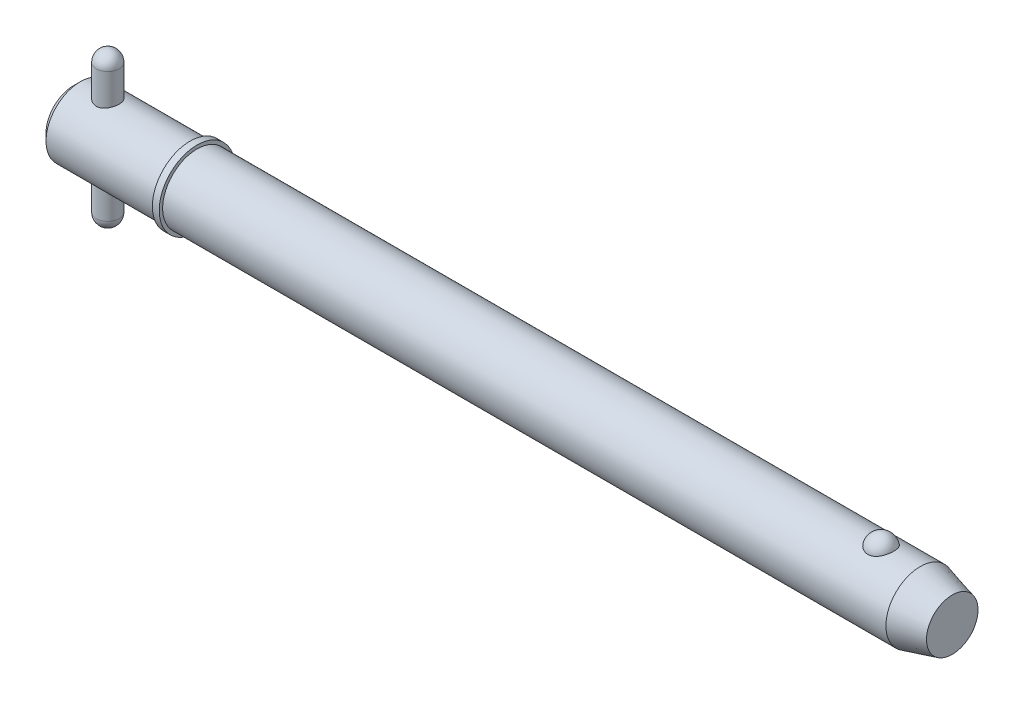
ISO-10303-21;
HEADER;
FILE_DESCRIPTION(('STEP AP214'),'2;1');
FILE_NAME('part.step','',(''),(''),'','','');
FILE_SCHEMA(('AUTOMOTIVE_DESIGN { 1 0 10303 214 1 1 1 1 }'));
ENDSEC;
DATA;
#1=APPLICATION_CONTEXT('core data for automotive mechanical design processes');
#2=APPLICATION_PROTOCOL_DEFINITION('international standard','automotive_design',2000,#1);
#3=PRODUCT_CONTEXT('',#1,'mechanical');
#4=PRODUCT('Part','Part','',(#3));
#5=PRODUCT_RELATED_PRODUCT_CATEGORY('part','',(#4));
#6=PRODUCT_DEFINITION_FORMATION('','',#4);
#7=PRODUCT_DEFINITION_CONTEXT('part definition',#1,'design');
#8=PRODUCT_DEFINITION('design','',#6,#7);
#9=PRODUCT_DEFINITION_SHAPE('','',#8);
#10=(LENGTH_UNIT() NAMED_UNIT(*) SI_UNIT(.MILLI.,.METRE.));
#11=(NAMED_UNIT(*) PLANE_ANGLE_UNIT() SI_UNIT($,.RADIAN.));
#12=(NAMED_UNIT(*) SI_UNIT($,.STERADIAN.) SOLID_ANGLE_UNIT());
#13=UNCERTAINTY_MEASURE_WITH_UNIT(LENGTH_MEASURE(1.E-05),#10,'distance_accuracy_value','');
#14=(GEOMETRIC_REPRESENTATION_CONTEXT(3) GLOBAL_UNCERTAINTY_ASSIGNED_CONTEXT((#13)) GLOBAL_UNIT_ASSIGNED_CONTEXT((#10,
#11,#12)) REPRESENTATION_CONTEXT('',''));
#15=CARTESIAN_POINT('',(0.,0.,0.));
#16=DIRECTION('',(0.,0.,1.));
#17=DIRECTION('',(1.,0.,0.));
#18=AXIS2_PLACEMENT_3D('',#15,#16,#17);
#19=CARTESIAN_POINT('',(7.14,15.875,0.));
#20=DIRECTION('',(0.,-1.,0.));
#21=DIRECTION('',(0.,0.,-1.));
#22=AXIS2_PLACEMENT_3D('',#19,#20,#21);
#23=CYLINDRICAL_SURFACE('',#22,2.38);
#24=CARTESIAN_POINT('',(7.14,-13.495,0.));
#25=DIRECTION('',(0.,-1.,0.));
#26=DIRECTION('',(0.,0.,-1.));
#27=AXIS2_PLACEMENT_3D('',#24,#25,#26);
#28=CIRCLE('',#27,2.38);
#29=CARTESIAN_POINT('',(7.14,-13.495,-2.38));
#30=VERTEX_POINT('',#29);
#31=EDGE_CURVE('P0_E10',#30,#30,#28,.F.);
#32=ORIENTED_EDGE('',*,*,#31,.T.);
#33=EDGE_LOOP('',(#32));
#34=FACE_BOUND('',#33,.T.);
#35=CARTESIAN_POINT('',(7.14,13.495,0.));
#36=DIRECTION('',(0.,-1.,0.));
#37=DIRECTION('',(0.,0.,-1.));
#38=AXIS2_PLACEMENT_3D('',#35,#36,#37);
#39=CIRCLE('',#38,2.38);
#40=CARTESIAN_POINT('',(7.14,13.495,-2.38));
#41=VERTEX_POINT('',#40);
#42=EDGE_CURVE('P0_E21',#41,#41,#39,.T.);
#43=ORIENTED_EDGE('',*,*,#42,.T.);
#44=EDGE_LOOP('',(#43));
#45=FACE_BOUND('',#44,.T.);
#46=ADVANCED_FACE('P0_F14',(#34,#45),#23,.T.);
#47=CARTESIAN_POINT('',(7.14,-13.495,0.));
#48=DIRECTION('',(0.,0.,1.));
#49=DIRECTION('',(1.,0.,0.));
#50=AXIS2_PLACEMENT_3D('',#47,#48,#49);
#51=SPHERICAL_SURFACE('',#50,2.38);
#52=CARTESIAN_POINT('',(7.14,-13.495,0.));
#53=DIRECTION('',(0.,-1.,0.));
#54=DIRECTION('',(0.,0.,-1.));
#55=AXIS2_PLACEMENT_3D('',#52,#53,#54);
#56=SPHERICAL_SURFACE('',#55,2.38);
#57=ORIENTED_EDGE('',*,*,#31,.F.);
#58=EDGE_LOOP('',(#57));
#59=FACE_BOUND('',#58,.T.);
#60=ADVANCED_FACE('P0_F29',(#59),#56,.T.);
#61=CARTESIAN_POINT('',(7.14,13.495,0.));
#62=DIRECTION('',(0.,0.,1.));
#63=DIRECTION('',(1.,0.,0.));
#64=AXIS2_PLACEMENT_3D('',#61,#62,#63);
#65=SPHERICAL_SURFACE('',#64,2.38);
#66=CARTESIAN_POINT('',(7.14,13.495,0.));
#67=DIRECTION('',(0.,-1.,0.));
#68=DIRECTION('',(0.,0.,-1.));
#69=AXIS2_PLACEMENT_3D('',#66,#67,#68);
#70=SPHERICAL_SURFACE('',#69,2.38);
#71=ORIENTED_EDGE('',*,*,#42,.F.);
#72=EDGE_LOOP('',(#71));
#73=FACE_BOUND('',#72,.T.);
#74=ADVANCED_FACE('P0_F16',(#73),#70,.T.);
#75=CLOSED_SHELL('',(#46,#60,#74));
#76=MANIFOLD_SOLID_BREP('P0_B1',#75);
#77=CARTESIAN_POINT('',(0.,0.,0.));
#78=DIRECTION('',(1.,0.,0.));
#79=DIRECTION('',(0.,0.,-1.));
#80=AXIS2_PLACEMENT_3D('',#77,#78,#79);
#81=CYLINDRICAL_SURFACE('',#80,7.145);
#82=CARTESIAN_POINT('',(176.18362424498,0.,0.));
#83=DIRECTION('',(1.,0.,0.));
#84=DIRECTION('',(0.,0.,-1.));
#85=AXIS2_PLACEMENT_3D('',#82,#83,#84);
#86=CIRCLE('',#85,7.145);
#87=CARTESIAN_POINT('',(176.18362424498,0.,-7.145));
#88=VERTEX_POINT('',#87);
#89=EDGE_CURVE('P1_E81',#88,#88,#86,.T.);
#90=ORIENTED_EDGE('',*,*,#89,.F.);
#91=EDGE_LOOP('',(#90));
#92=FACE_BOUND('',#91,.T.);
#93=CARTESIAN_POINT('',(25.7,0.,0.));
#94=DIRECTION('',(1.,0.,0.));
#95=DIRECTION('',(0.,0.,-1.));
#96=AXIS2_PLACEMENT_3D('',#93,#94,#95);
#97=CIRCLE('',#96,7.145);
#98=CARTESIAN_POINT('',(25.7,0.,-7.145));
#99=VERTEX_POINT('',#98);
#100=EDGE_CURVE('P1_E85',#99,#99,#97,.T.);
#101=ORIENTED_EDGE('',*,*,#100,.T.);
#102=EDGE_LOOP('',(#101));
#103=FACE_BOUND('',#102,.T.);
#104=CARTESIAN_POINT('',(168.039503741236,6.60328629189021,2.72903557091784));
#105=CARTESIAN_POINT('',(167.898315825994,6.60329644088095,2.7290249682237));
#106=CARTESIAN_POINT('',(167.756883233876,6.60799490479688,2.71772840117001));
#107=CARTESIAN_POINT('',(167.477955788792,6.62628236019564,2.6728193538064));
#108=CARTESIAN_POINT('',(167.340472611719,6.63989534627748,2.63914664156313));
#109=CARTESIAN_POINT('',(167.073889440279,6.67440775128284,2.55059642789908));
#110=CARTESIAN_POINT('',(166.944768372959,6.69528793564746,2.49577486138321));
#111=CARTESIAN_POINT('',(166.697869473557,6.74205585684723,2.36651799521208));
#112=CARTESIAN_POINT('',(166.580086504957,6.76794130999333,2.2920916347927));
#113=CARTESIAN_POINT('',(166.35516710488,6.82286177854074,2.12312937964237));
#114=CARTESIAN_POINT('',(166.248440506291,6.85196655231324,2.0280710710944));
#115=CARTESIAN_POINT('',(166.051918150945,6.90970232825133,1.82167822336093));
#116=CARTESIAN_POINT('',(165.962127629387,6.93833318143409,1.71033867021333));
#117=CARTESIAN_POINT('',(165.797667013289,6.9935167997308,1.46891951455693));
#118=CARTESIAN_POINT('',(165.723844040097,7.01992110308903,1.33822781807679));
#119=CARTESIAN_POINT('',(165.598088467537,7.06643385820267,1.0656656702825));
#120=CARTESIAN_POINT('',(165.54615735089,7.08654188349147,0.923794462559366));
#121=CARTESIAN_POINT('',(165.464732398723,7.11862399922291,0.630993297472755));
#122=CARTESIAN_POINT('',(165.435516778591,7.13049704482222,0.479974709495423));
#123=CARTESIAN_POINT('',(165.401174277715,7.14449484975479,0.174782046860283));
#124=CARTESIAN_POINT('',(165.396046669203,7.14661990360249,0.020608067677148));
#125=CARTESIAN_POINT('',(165.409938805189,7.14092465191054,-0.285506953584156));
#126=CARTESIAN_POINT('',(165.428810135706,7.1331654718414,-0.437455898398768));
#127=CARTESIAN_POINT('',(165.490062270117,7.10859076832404,-0.73577860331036));
#128=CARTESIAN_POINT('',(165.532443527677,7.0917750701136,-0.882152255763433));
#129=CARTESIAN_POINT('',(165.639934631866,7.05076716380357,-1.16543149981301));
#130=CARTESIAN_POINT('',(165.705075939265,7.02656475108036,-1.30232366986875));
#131=CARTESIAN_POINT('',(165.856759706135,6.97329145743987,-1.56265907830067));
#132=CARTESIAN_POINT('',(165.943303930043,6.94422017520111,-1.68610120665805));
#133=CARTESIAN_POINT('',(166.136465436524,6.88415108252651,-1.91671004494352));
#134=CARTESIAN_POINT('',(166.243180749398,6.85314438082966,-2.02379244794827));
#135=CARTESIAN_POINT('',(166.473974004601,6.79282069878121,-2.21787433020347));
#136=CARTESIAN_POINT('',(166.598050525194,6.76350358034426,-2.30487545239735));
#137=CARTESIAN_POINT('',(166.857678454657,6.71060580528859,-2.45458647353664));
#138=CARTESIAN_POINT('',(166.992938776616,6.68691885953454,-2.51776240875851));
#139=CARTESIAN_POINT('',(167.273277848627,6.64741247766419,-2.62030218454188));
#140=CARTESIAN_POINT('',(167.418352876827,6.63159007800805,-2.65967499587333));
#141=CARTESIAN_POINT('',(167.706347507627,6.61038594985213,-2.71193301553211));
#142=CARTESIAN_POINT('',(167.84900807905,6.60451880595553,-2.72605165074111));
#143=CARTESIAN_POINT('',(168.13480047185,6.60240611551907,-2.73116688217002));
#144=CARTESIAN_POINT('',(168.277932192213,6.60615862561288,-2.7221681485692));
#145=CARTESIAN_POINT('',(168.555848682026,6.62256094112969,-2.68200435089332));
#146=CARTESIAN_POINT('',(168.690754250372,6.63492533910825,-2.65154998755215));
#147=CARTESIAN_POINT('',(168.95332009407,6.66687445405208,-2.57015684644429));
#148=CARTESIAN_POINT('',(169.08097978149,6.68645975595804,-2.51921640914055));
#149=CARTESIAN_POINT('',(169.328577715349,6.73127274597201,-2.39693610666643));
#150=CARTESIAN_POINT('',(169.448287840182,6.7566138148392,-2.32517694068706));
#151=CARTESIAN_POINT('',(169.674159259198,6.8100600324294,-2.16363812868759));
#152=CARTESIAN_POINT('',(169.780317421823,6.83816581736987,-2.07385432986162));
#153=CARTESIAN_POINT('',(169.981862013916,6.89580469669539,-1.87357235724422));
#154=CARTESIAN_POINT('',(170.076440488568,6.92533863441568,-1.76226074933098));
#155=CARTESIAN_POINT('',(170.246332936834,6.98139526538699,-1.5251169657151));
#156=CARTESIAN_POINT('',(170.321643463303,7.0079174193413,-1.39928219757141));
#157=CARTESIAN_POINT('',(170.453595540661,7.05607625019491,-1.1321597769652));
#158=CARTESIAN_POINT('',(170.509568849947,7.07753119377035,-0.990508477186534));
#159=CARTESIAN_POINT('',(170.598296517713,7.11222355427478,-0.699154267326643));
#160=CARTESIAN_POINT('',(170.631050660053,7.12546089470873,-0.549451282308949));
#161=CARTESIAN_POINT('',(170.672689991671,7.14237584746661,-0.246120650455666));
#162=CARTESIAN_POINT('',(170.681558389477,7.14604673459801,-0.0924903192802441));
#163=CARTESIAN_POINT('',(170.675194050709,7.14343510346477,0.214181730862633));
#164=CARTESIAN_POINT('',(170.659961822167,7.13715279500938,0.367223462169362));
#165=CARTESIAN_POINT('',(170.605845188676,7.1153294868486,0.667595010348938));
#166=CARTESIAN_POINT('',(170.567077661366,7.09983424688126,0.814949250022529));
#167=CARTESIAN_POINT('',(170.466770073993,7.06119140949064,1.1006322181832));
#168=CARTESIAN_POINT('',(170.405228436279,7.03804328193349,1.23896032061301));
#169=CARTESIAN_POINT('',(170.260207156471,6.98632429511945,1.50352300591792));
#170=CARTESIAN_POINT('',(170.176606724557,6.95772382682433,1.62968561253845));
#171=CARTESIAN_POINT('',(169.98938046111,6.89823072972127,1.86554304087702));
#172=CARTESIAN_POINT('',(169.885755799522,6.86733823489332,1.97523882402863));
#173=CARTESIAN_POINT('',(169.661076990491,6.80676456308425,2.174822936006));
#174=CARTESIAN_POINT('',(169.540067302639,6.7770805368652,2.26476035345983));
#175=CARTESIAN_POINT('',(169.283340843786,6.7223050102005,2.42252989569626));
#176=CARTESIAN_POINT('',(169.14761851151,6.69721525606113,2.4903536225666));
#177=CARTESIAN_POINT('',(168.870402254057,6.65552591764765,2.59967646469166));
#178=CARTESIAN_POINT('',(168.729281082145,6.63865794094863,2.6420201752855));
#179=CARTESIAN_POINT('',(168.441444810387,6.61425039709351,2.70255841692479));
#180=CARTESIAN_POINT('',(168.294748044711,6.606682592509,2.72082606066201));
#181=CARTESIAN_POINT('',(168.111679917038,6.60358754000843,2.72830331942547));
#182=CARTESIAN_POINT('',(168.075599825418,6.60328369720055,2.72903828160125));
#183=CARTESIAN_POINT('',(168.039503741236,6.60328629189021,2.72903557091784));
#184=B_SPLINE_CURVE_WITH_KNOTS('',3,(#104,#105,#106,#107,#108,#109,#110,#111,#112,#113,#114,
#115,#116,#117,#118,#119,#120,#121,#122,#123,#124,#125,#126,#127,#128,#129,#130,#131,#132,#133,
#134,#135,#136,#137,#138,#139,#140,#141,#142,#143,#144,#145,#146,#147,#148,#149,#150,#151,#152,
#153,#154,#155,#156,#157,#158,#159,#160,#161,#162,#163,#164,#165,#166,#167,#168,#169,#170,#171,
#172,#173,#174,#175,#176,#177,#178,#179,#180,#181,#182,#183),.UNSPECIFIED.,.T.,.F.,(4,2,2,2,2,2,
2,2,2,2,2,2,2,2,2,2,2,2,2,2,2,2,2,2,2,2,2,2,2,2,2,2,2,2,2,2,2,2,2,4),(0.,0.423468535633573,
0.848081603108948,1.27157926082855,1.69488414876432,2.13051395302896,2.56627819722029,
3.02136706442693,3.47648674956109,3.93709649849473,4.39769233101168,4.85545355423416,
5.31322361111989,5.77162895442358,6.23007210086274,6.6908033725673,7.15149693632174,
7.60264329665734,8.05361952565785,8.48189729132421,8.91008854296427,9.32472524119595,
9.73939553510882,10.1630783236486,10.5868588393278,11.0319070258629,11.4770347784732,
11.9362874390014,12.3955443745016,12.8551240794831,13.3146940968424,13.7720003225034,
14.2293382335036,14.6892343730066,15.1491036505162,15.6078171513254,16.0667046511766,
16.5093965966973,16.9507410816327,17.0590049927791),.UNSPECIFIED.);
#185=CARTESIAN_POINT('',(168.039503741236,6.60328629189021,2.72903557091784));
#186=VERTEX_POINT('',#185);
#187=EDGE_CURVE('P1_E35',#186,#186,#184,.T.);
#188=ORIENTED_EDGE('',*,*,#187,.T.);
#189=EDGE_LOOP('',(#188));
#190=FACE_BOUND('',#189,.T.);
#191=ADVANCED_FACE('P1_F13',(#92,#103,#190),#81,.T.);
#192=CARTESIAN_POINT('',(0.,0.,0.));
#193=DIRECTION('',(-1.,0.,0.));
#194=DIRECTION('',(0.,0.,1.));
#195=AXIS2_PLACEMENT_3D('',#192,#193,#194);
#196=PLANE('',#195);
#197=CARTESIAN_POINT('',(0.,0.,0.));
#198=DIRECTION('',(1.,0.,0.));
#199=DIRECTION('',(0.,0.,-1.));
#200=AXIS2_PLACEMENT_3D('',#197,#198,#199);
#201=CIRCLE('',#200,5.716);
#202=CARTESIAN_POINT('',(0.,0.,-5.716));
#203=VERTEX_POINT('',#202);
#204=EDGE_CURVE('P1_E9',#203,#203,#201,.T.);
#205=ORIENTED_EDGE('',*,*,#204,.F.);
#206=EDGE_LOOP('',(#205));
#207=FACE_BOUND('',#206,.T.);
#208=ADVANCED_FACE('P1_F15',(#207),#196,.T.);
#209=CARTESIAN_POINT('',(1.42899999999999,0.,0.));
#210=DIRECTION('',(1.,0.,0.));
#211=DIRECTION('',(0.,0.,-1.));
#212=AXIS2_PLACEMENT_3D('',#209,#210,#211);
#213=CONICAL_SURFACE('',#212,7.145,0.78539816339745);
#214=ORIENTED_EDGE('',*,*,#204,.T.);
#215=EDGE_LOOP('',(#214));
#216=FACE_BOUND('',#215,.T.);
#217=CARTESIAN_POINT('',(1.42899999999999,0.,0.));
#218=DIRECTION('',(1.,0.,0.));
#219=DIRECTION('',(0.,0.,-1.));
#220=AXIS2_PLACEMENT_3D('',#217,#218,#219);
#221=CIRCLE('',#220,7.145);
#222=CARTESIAN_POINT('',(1.42899999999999,0.,-7.145));
#223=VERTEX_POINT('',#222);
#224=EDGE_CURVE('P1_E26',#223,#223,#221,.T.);
#225=ORIENTED_EDGE('',*,*,#224,.F.);
#226=EDGE_LOOP('',(#225));
#227=FACE_BOUND('',#226,.T.);
#228=ADVANCED_FACE('P1_F77',(#216,#227),#213,.T.);
#229=CARTESIAN_POINT('',(0.,0.,0.));
#230=DIRECTION('',(1.,0.,0.));
#231=DIRECTION('',(0.,0.,-1.));
#232=AXIS2_PLACEMENT_3D('',#229,#230,#231);
#233=CYLINDRICAL_SURFACE('',#232,7.145);
#234=CARTESIAN_POINT('',(7.14,-6.73695962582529,2.38));
#235=CARTESIAN_POINT('',(7.01035997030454,-6.73695921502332,2.38000059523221));
#236=CARTESIAN_POINT('',(6.88072348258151,-6.74074253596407,2.36937183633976));
#237=CARTESIAN_POINT('',(6.62529075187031,-6.75538853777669,2.32728080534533));
#238=CARTESIAN_POINT('',(6.49949514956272,-6.76625239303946,2.29581507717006));
#239=CARTESIAN_POINT('',(6.2554858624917,-6.79369535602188,2.21327763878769));
#240=CARTESIAN_POINT('',(6.13725786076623,-6.81026326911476,2.16224430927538));
#241=CARTESIAN_POINT('',(5.91100349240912,-6.84723128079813,2.04215132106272));
#242=CARTESIAN_POINT('',(5.80297937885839,-6.86763222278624,1.97308769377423));
#243=CARTESIAN_POINT('',(5.59597854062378,-6.91086152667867,1.81600414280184));
#244=CARTESIAN_POINT('',(5.49745861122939,-6.93375032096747,1.72739874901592));
#245=CARTESIAN_POINT('',(5.31636508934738,-6.97886546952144,1.53499636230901));
#246=CARTESIAN_POINT('',(5.23379405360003,-7.00109171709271,1.43119693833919));
#247=CARTESIAN_POINT('',(5.08487013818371,-7.04307708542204,1.20801318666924));
#248=CARTESIAN_POINT('',(5.01899578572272,-7.06275685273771,1.08829330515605));
#249=CARTESIAN_POINT('',(4.90850130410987,-7.09671988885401,0.838703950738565));
#250=CARTESIAN_POINT('',(4.86387545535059,-7.11100460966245,0.70883722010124));
#251=CARTESIAN_POINT('',(4.79869354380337,-7.13213998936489,0.44742990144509));
#252=CARTESIAN_POINT('',(4.77735497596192,-7.13923172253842,0.316104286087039));
#253=CARTESIAN_POINT('',(4.75686536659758,-7.14603777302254,0.0515578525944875));
#254=CARTESIAN_POINT('',(4.75770861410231,-7.14575398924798,-0.0816624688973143));
#255=CARTESIAN_POINT('',(4.78106216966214,-7.13800438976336,-0.340678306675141));
#256=CARTESIAN_POINT('',(4.80272255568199,-7.13082030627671,-0.466560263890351));
#257=CARTESIAN_POINT('',(4.86569013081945,-7.11043095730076,-0.712788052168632));
#258=CARTESIAN_POINT('',(4.90699865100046,-7.09722528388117,-0.833133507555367));
#259=CARTESIAN_POINT('',(5.00858673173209,-7.06591754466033,-1.06673173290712));
#260=CARTESIAN_POINT('',(5.06910834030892,-7.0477534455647,-1.17987058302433));
#261=CARTESIAN_POINT('',(5.20720514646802,-7.00841977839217,-1.39463797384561));
#262=CARTESIAN_POINT('',(5.28478508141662,-6.987249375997,-1.49626330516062));
#263=CARTESIAN_POINT('',(5.4590800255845,-6.94296010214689,-1.69017445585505));
#264=CARTESIAN_POINT('',(5.55652324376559,-6.91979641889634,-1.78179645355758));
#265=CARTESIAN_POINT('',(5.76558873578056,-6.87497076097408,-1.94761348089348));
#266=CARTESIAN_POINT('',(5.87721318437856,-6.85330901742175,-2.02180583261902));
#267=CARTESIAN_POINT('',(6.11357367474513,-6.81369485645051,-2.15157488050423));
#268=CARTESIAN_POINT('',(6.23847358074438,-6.79579956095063,-2.20687188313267));
#269=CARTESIAN_POINT('',(6.49655785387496,-6.76640630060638,-2.29542443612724));
#270=CARTESIAN_POINT('',(6.62973872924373,-6.75490565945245,-2.32868920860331));
#271=CARTESIAN_POINT('',(6.89417536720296,-6.74020933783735,-2.37088225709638));
#272=CARTESIAN_POINT('',(7.02524746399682,-6.73666278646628,-2.38083959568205));
#273=CARTESIAN_POINT('',(7.28721035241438,-6.73729555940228,-2.37904974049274));
#274=CARTESIAN_POINT('',(7.41810117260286,-6.7414734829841,-2.36730648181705));
#275=CARTESIAN_POINT('',(7.67130717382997,-6.75673471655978,-2.32337336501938));
#276=CARTESIAN_POINT('',(7.79376251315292,-6.76757635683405,-2.29189834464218));
#277=CARTESIAN_POINT('',(8.03162917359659,-6.79467771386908,-2.21025275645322));
#278=CARTESIAN_POINT('',(8.14703924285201,-6.8109383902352,-2.16007887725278));
#279=CARTESIAN_POINT('',(8.37159169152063,-6.84768362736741,-2.04065289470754));
#280=CARTESIAN_POINT('',(8.48041962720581,-6.86828569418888,-1.97084668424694));
#281=CARTESIAN_POINT('',(8.68518919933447,-6.91116416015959,-1.8147657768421));
#282=CARTESIAN_POINT('',(8.78112702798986,-6.93344105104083,-1.72848623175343));
#283=CARTESIAN_POINT('',(8.96215574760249,-6.97845348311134,-1.53698616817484));
#284=CARTESIAN_POINT('',(9.04650427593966,-7.00115965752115,-1.43105491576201));
#285=CARTESIAN_POINT('',(9.19627592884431,-7.04341676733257,-1.20598377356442));
#286=CARTESIAN_POINT('',(9.26169972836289,-7.06296781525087,-1.08684435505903));
#287=CARTESIAN_POINT('',(9.37116617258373,-7.0966205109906,-0.83933303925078));
#288=CARTESIAN_POINT('',(9.41534821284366,-7.11075755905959,-0.711027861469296));
#289=CARTESIAN_POINT('',(9.48132660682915,-7.13214194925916,-0.448245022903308));
#290=CARTESIAN_POINT('',(9.50313102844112,-7.13939177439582,-0.313769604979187));
#291=CARTESIAN_POINT('',(9.5230098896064,-7.14599771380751,-0.049254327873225));
#292=CARTESIAN_POINT('',(9.52215013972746,-7.14570837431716,0.0806974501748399));
#293=CARTESIAN_POINT('',(9.49935359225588,-7.13814116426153,0.338518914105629));
#294=CARTESIAN_POINT('',(9.47741850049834,-7.13086385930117,0.466388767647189));
#295=CARTESIAN_POINT('',(9.4138005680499,-7.11026814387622,0.714400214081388));
#296=CARTESIAN_POINT('',(9.37243609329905,-7.09704726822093,0.834632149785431));
#297=CARTESIAN_POINT('',(9.27142829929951,-7.06592602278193,1.06649582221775));
#298=CARTESIAN_POINT('',(9.2117816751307,-7.04802480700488,1.1781259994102));
#299=CARTESIAN_POINT('',(9.07336776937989,-7.00856499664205,1.39411030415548));
#300=CARTESIAN_POINT('',(8.99397590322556,-6.98689577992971,1.49804368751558));
#301=CARTESIAN_POINT('',(8.81938810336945,-6.9426110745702,1.69146078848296));
#302=CARTESIAN_POINT('',(8.72418713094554,-6.91999528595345,1.78093988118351));
#303=CARTESIAN_POINT('',(8.51623540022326,-6.87531507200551,1.94646188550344));
#304=CARTESIAN_POINT('',(8.4029442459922,-6.85330672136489,2.02184316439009));
#305=CARTESIAN_POINT('',(8.16461714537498,-6.81342065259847,2.1524427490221));
#306=CARTESIAN_POINT('',(8.03958429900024,-6.7955418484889,2.20766635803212));
#307=CARTESIAN_POINT('',(7.78712566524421,-6.76686117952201,2.29403636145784));
#308=CARTESIAN_POINT('',(7.66006989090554,-6.75577342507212,2.32616709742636));
#309=CARTESIAN_POINT('',(7.40200728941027,-6.74082409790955,2.36914495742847));
#310=CARTESIAN_POINT('',(7.27100183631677,-6.73696004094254,2.37999939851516));
#311=CARTESIAN_POINT('',(7.14,-6.73695962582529,2.38));
#312=B_SPLINE_CURVE_WITH_KNOTS('',3,(#234,#235,#236,#237,#238,#239,#240,#241,#242,#243,#244,
#245,#246,#247,#248,#249,#250,#251,#252,#253,#254,#255,#256,#257,#258,#259,#260,#261,#262,#263,
#264,#265,#266,#267,#268,#269,#270,#271,#272,#273,#274,#275,#276,#277,#278,#279,#280,#281,#282,
#283,#284,#285,#286,#287,#288,#289,#290,#291,#292,#293,#294,#295,#296,#297,#298,#299,#300,#301,
#302,#303,#304,#305,#306,#307,#308,#309,#310,#311),.UNSPECIFIED.,.T.,.F.,(4,2,2,2,2,2,2,2,2,2,2,
2,2,2,2,2,2,2,2,2,2,2,2,2,2,2,2,2,2,2,2,2,2,2,2,2,2,2,4),(0.,0.388434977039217,
0.776934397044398,1.16467566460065,1.55250234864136,1.9540847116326,2.35573139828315,
2.76784120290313,3.17984001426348,3.57752248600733,3.97510257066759,4.35711073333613,
4.7391447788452,5.12619663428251,5.51335611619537,5.91871976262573,6.3241456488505,
6.73533623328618,7.14635459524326,7.53885245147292,7.93127914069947,8.31025106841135,
8.68929014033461,9.08033871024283,9.47150254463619,9.88145528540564,10.2913934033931,
10.6986033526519,11.1056664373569,11.4936225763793,11.8815473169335,12.2633262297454,
12.645174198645,13.0411187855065,13.437189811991,13.8487371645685,14.2601761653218,
14.6528265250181,15.0453418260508),.UNSPECIFIED.);
#313=CARTESIAN_POINT('',(7.14,-6.73695962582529,2.38));
#314=VERTEX_POINT('',#313);
#315=EDGE_CURVE('P1_E17',#314,#314,#312,.T.);
#316=ORIENTED_EDGE('',*,*,#315,.F.);
#317=EDGE_LOOP('',(#316));
#318=FACE_BOUND('',#317,.T.);
#319=CARTESIAN_POINT('',(7.14,6.73695962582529,2.38));
#320=CARTESIAN_POINT('',(7.26964002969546,6.73695921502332,2.38000059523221));
#321=CARTESIAN_POINT('',(7.39927651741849,6.74074253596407,2.36937183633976));
#322=CARTESIAN_POINT('',(7.65470924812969,6.75538853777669,2.32728080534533));
#323=CARTESIAN_POINT('',(7.78050485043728,6.76625239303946,2.29581507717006));
#324=CARTESIAN_POINT('',(8.02451413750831,6.79369535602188,2.21327763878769));
#325=CARTESIAN_POINT('',(8.14274213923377,6.81026326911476,2.16224430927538));
#326=CARTESIAN_POINT('',(8.36899650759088,6.84723128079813,2.04215132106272));
#327=CARTESIAN_POINT('',(8.47702062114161,6.86763222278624,1.97308769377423));
#328=CARTESIAN_POINT('',(8.68402145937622,6.91086152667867,1.81600414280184));
#329=CARTESIAN_POINT('',(8.78254138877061,6.93375032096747,1.72739874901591));
#330=CARTESIAN_POINT('',(8.96363491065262,6.97886546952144,1.53499636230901));
#331=CARTESIAN_POINT('',(9.04620594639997,7.00109171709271,1.43119693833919));
#332=CARTESIAN_POINT('',(9.19512986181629,7.04307708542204,1.20801318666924));
#333=CARTESIAN_POINT('',(9.26100421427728,7.06275685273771,1.08829330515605));
#334=CARTESIAN_POINT('',(9.37149869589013,7.09671988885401,0.838703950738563));
#335=CARTESIAN_POINT('',(9.41612454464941,7.11100460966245,0.708837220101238));
#336=CARTESIAN_POINT('',(9.48130645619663,7.13213998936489,0.447429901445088));
#337=CARTESIAN_POINT('',(9.50264502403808,7.13923172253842,0.316104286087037));
#338=CARTESIAN_POINT('',(9.52313463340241,7.14603777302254,0.0515578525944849));
#339=CARTESIAN_POINT('',(9.52229138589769,7.14575398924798,-0.0816624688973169));
#340=CARTESIAN_POINT('',(9.49893783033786,7.13800438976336,-0.340678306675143));
#341=CARTESIAN_POINT('',(9.47727744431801,7.13082030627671,-0.466560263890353));
#342=CARTESIAN_POINT('',(9.41430986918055,7.11043095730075,-0.712788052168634));
#343=CARTESIAN_POINT('',(9.37300134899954,7.09722528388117,-0.833133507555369));
#344=CARTESIAN_POINT('',(9.27141326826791,7.06591754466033,-1.06673173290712));
#345=CARTESIAN_POINT('',(9.21089165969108,7.0477534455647,-1.17987058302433));
#346=CARTESIAN_POINT('',(9.07279485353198,7.00841977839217,-1.39463797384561));
#347=CARTESIAN_POINT('',(8.99521491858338,6.987249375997,-1.49626330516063));
#348=CARTESIAN_POINT('',(8.82091997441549,6.94296010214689,-1.69017445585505));
#349=CARTESIAN_POINT('',(8.72347675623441,6.91979641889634,-1.78179645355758));
#350=CARTESIAN_POINT('',(8.51441126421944,6.87497076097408,-1.94761348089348));
#351=CARTESIAN_POINT('',(8.40278681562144,6.85330901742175,-2.02180583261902));
#352=CARTESIAN_POINT('',(8.16642632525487,6.81369485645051,-2.15157488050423));
#353=CARTESIAN_POINT('',(8.04152641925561,6.79579956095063,-2.20687188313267));
#354=CARTESIAN_POINT('',(7.78344214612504,6.76640630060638,-2.29542443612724));
#355=CARTESIAN_POINT('',(7.65026127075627,6.75490565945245,-2.32868920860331));
#356=CARTESIAN_POINT('',(7.38582463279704,6.74020933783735,-2.37088225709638));
#357=CARTESIAN_POINT('',(7.25475253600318,6.73666278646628,-2.38083959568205));
#358=CARTESIAN_POINT('',(6.99278964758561,6.73729555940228,-2.37904974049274));
#359=CARTESIAN_POINT('',(6.86189882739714,6.7414734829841,-2.36730648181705));
#360=CARTESIAN_POINT('',(6.60869282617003,6.75673471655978,-2.32337336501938));
#361=CARTESIAN_POINT('',(6.48623748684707,6.76757635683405,-2.29189834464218));
#362=CARTESIAN_POINT('',(6.2483708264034,6.79467771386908,-2.21025275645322));
#363=CARTESIAN_POINT('',(6.13296075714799,6.8109383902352,-2.16007887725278));
#364=CARTESIAN_POINT('',(5.90840830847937,6.84768362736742,-2.04065289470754));
#365=CARTESIAN_POINT('',(5.79958037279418,6.86828569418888,-1.97084668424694));
#366=CARTESIAN_POINT('',(5.59481080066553,6.91116416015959,-1.8147657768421));
#367=CARTESIAN_POINT('',(5.49887297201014,6.93344105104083,-1.72848623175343));
#368=CARTESIAN_POINT('',(5.31784425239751,6.97845348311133,-1.53698616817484));
#369=CARTESIAN_POINT('',(5.23349572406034,7.00115965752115,-1.43105491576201));
#370=CARTESIAN_POINT('',(5.08372407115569,7.04341676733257,-1.20598377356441));
#371=CARTESIAN_POINT('',(5.01830027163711,7.06296781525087,-1.08684435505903));
#372=CARTESIAN_POINT('',(4.90883382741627,7.0966205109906,-0.839333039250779));
#373=CARTESIAN_POINT('',(4.86465178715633,7.11075755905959,-0.711027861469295));
#374=CARTESIAN_POINT('',(4.79867339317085,7.13214194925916,-0.448245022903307));
#375=CARTESIAN_POINT('',(4.77686897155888,7.13939177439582,-0.313769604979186));
#376=CARTESIAN_POINT('',(4.7569901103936,7.14599771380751,-0.0492543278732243));
#377=CARTESIAN_POINT('',(4.75784986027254,7.14570837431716,0.0806974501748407));
#378=CARTESIAN_POINT('',(4.78064640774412,7.13814116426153,0.33851891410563));
#379=CARTESIAN_POINT('',(4.80258149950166,7.13086385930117,0.46638876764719));
#380=CARTESIAN_POINT('',(4.8661994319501,7.11026814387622,0.714400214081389));
#381=CARTESIAN_POINT('',(4.90756390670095,7.09704726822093,0.834632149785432));
#382=CARTESIAN_POINT('',(5.00857170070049,7.06592602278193,1.06649582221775));
#383=CARTESIAN_POINT('',(5.0682183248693,7.04802480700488,1.1781259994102));
#384=CARTESIAN_POINT('',(5.20663223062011,7.00856499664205,1.39411030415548));
#385=CARTESIAN_POINT('',(5.28602409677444,6.98689577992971,1.49804368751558));
#386=CARTESIAN_POINT('',(5.46061189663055,6.9426110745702,1.69146078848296));
#387=CARTESIAN_POINT('',(5.55581286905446,6.91999528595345,1.78093988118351));
#388=CARTESIAN_POINT('',(5.76376459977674,6.87531507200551,1.94646188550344));
#389=CARTESIAN_POINT('',(5.8770557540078,6.85330672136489,2.02184316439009));
#390=CARTESIAN_POINT('',(6.11538285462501,6.81342065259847,2.1524427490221));
#391=CARTESIAN_POINT('',(6.24041570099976,6.7955418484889,2.20766635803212));
#392=CARTESIAN_POINT('',(6.4928743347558,6.76686117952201,2.29403636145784));
#393=CARTESIAN_POINT('',(6.61993010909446,6.75577342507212,2.32616709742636));
#394=CARTESIAN_POINT('',(6.87799271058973,6.74082409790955,2.36914495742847));
#395=CARTESIAN_POINT('',(7.00899816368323,6.73696004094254,2.37999939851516));
#396=CARTESIAN_POINT('',(7.14,6.73695962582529,2.38));
#397=B_SPLINE_CURVE_WITH_KNOTS('',3,(#319,#320,#321,#322,#323,#324,#325,#326,#327,#328,#329,
#330,#331,#332,#333,#334,#335,#336,#337,#338,#339,#340,#341,#342,#343,#344,#345,#346,#347,#348,
#349,#350,#351,#352,#353,#354,#355,#356,#357,#358,#359,#360,#361,#362,#363,#364,#365,#366,#367,
#368,#369,#370,#371,#372,#373,#374,#375,#376,#377,#378,#379,#380,#381,#382,#383,#384,#385,#386,
#387,#388,#389,#390,#391,#392,#393,#394,#395,#396),.UNSPECIFIED.,.T.,.F.,(4,2,2,2,2,2,2,2,2,2,2,
2,2,2,2,2,2,2,2,2,2,2,2,2,2,2,2,2,2,2,2,2,2,2,2,2,2,2,4),(0.,0.388434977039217,
0.776934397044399,1.16467566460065,1.55250234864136,1.9540847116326,2.35573139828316,
2.76784120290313,3.17984001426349,3.57752248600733,3.97510257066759,4.35711073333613,
4.73914477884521,5.12619663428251,5.51335611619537,5.91871976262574,6.3241456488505,
6.73533623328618,7.14635459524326,7.53885245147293,7.93127914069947,8.31025106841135,
8.68929014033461,9.08033871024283,9.47150254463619,9.88145528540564,10.2913934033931,
10.6986033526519,11.1056664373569,11.4936225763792,11.8815473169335,12.2633262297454,
12.645174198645,13.0411187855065,13.437189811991,13.8487371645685,14.2601761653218,
14.6528265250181,15.0453418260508),.UNSPECIFIED.);
#398=CARTESIAN_POINT('',(7.14,6.73695962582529,2.38));
#399=VERTEX_POINT('',#398);
#400=EDGE_CURVE('P1_E43',#399,#399,#397,.T.);
#401=ORIENTED_EDGE('',*,*,#400,.F.);
#402=EDGE_LOOP('',(#401));
#403=FACE_BOUND('',#402,.T.);
#404=ORIENTED_EDGE('',*,*,#224,.T.);
#405=EDGE_LOOP('',(#404));
#406=FACE_BOUND('',#405,.T.);
#407=CARTESIAN_POINT('',(24.271,0.,0.));
#408=DIRECTION('',(1.,0.,0.));
#409=DIRECTION('',(0.,0.,-1.));
#410=AXIS2_PLACEMENT_3D('',#407,#408,#409);
#411=CIRCLE('',#410,7.145);
#412=CARTESIAN_POINT('',(24.271,0.,-7.145));
#413=VERTEX_POINT('',#412);
#414=EDGE_CURVE('P1_E31',#413,#413,#411,.T.);
#415=ORIENTED_EDGE('',*,*,#414,.F.);
#416=EDGE_LOOP('',(#415));
#417=FACE_BOUND('',#416,.T.);
#418=ADVANCED_FACE('P1_F103',(#318,#403,#406,#417),#233,.T.);
#419=CARTESIAN_POINT('',(24.271,7.145,0.));
#420=DIRECTION('',(-1.,0.,0.));
#421=DIRECTION('',(0.,0.,1.));
#422=AXIS2_PLACEMENT_3D('',#419,#420,#421);
#423=PLANE('',#422);
#424=ORIENTED_EDGE('',*,*,#414,.T.);
#425=EDGE_LOOP('',(#424));
#426=FACE_BOUND('',#425,.T.);
#427=CARTESIAN_POINT('',(24.271,0.,0.));
#428=DIRECTION('',(1.,0.,0.));
#429=DIRECTION('',(0.,0.,-1.));
#430=AXIS2_PLACEMENT_3D('',#427,#428,#429);
#431=CIRCLE('',#430,7.8595);
#432=CARTESIAN_POINT('',(24.271,0.,-7.8595));
#433=VERTEX_POINT('',#432);
#434=EDGE_CURVE('P1_E91',#433,#433,#431,.T.);
#435=ORIENTED_EDGE('',*,*,#434,.F.);
#436=EDGE_LOOP('',(#435));
#437=FACE_BOUND('',#436,.T.);
#438=ADVANCED_FACE('P1_F100',(#426,#437),#423,.T.);
#439=CARTESIAN_POINT('',(0.,0.,0.));
#440=DIRECTION('',(1.,0.,0.));
#441=DIRECTION('',(0.,0.,-1.));
#442=AXIS2_PLACEMENT_3D('',#439,#440,#441);
#443=CYLINDRICAL_SURFACE('',#442,7.8595);
#444=ORIENTED_EDGE('',*,*,#434,.T.);
#445=EDGE_LOOP('',(#444));
#446=FACE_BOUND('',#445,.T.);
#447=CARTESIAN_POINT('',(25.7,0.,0.));
#448=DIRECTION('',(1.,0.,0.));
#449=DIRECTION('',(0.,0.,-1.));
#450=AXIS2_PLACEMENT_3D('',#447,#448,#449);
#451=CIRCLE('',#450,7.8595);
#452=CARTESIAN_POINT('',(25.7,0.,-7.8595));
#453=VERTEX_POINT('',#452);
#454=EDGE_CURVE('P1_E88',#453,#453,#451,.T.);
#455=ORIENTED_EDGE('',*,*,#454,.F.);
#456=EDGE_LOOP('',(#455));
#457=FACE_BOUND('',#456,.T.);
#458=ADVANCED_FACE('P1_F68',(#446,#457),#443,.T.);
#459=CARTESIAN_POINT('',(25.7,7.8595,0.));
#460=DIRECTION('',(1.,0.,0.));
#461=DIRECTION('',(0.,0.,-1.));
#462=AXIS2_PLACEMENT_3D('',#459,#460,#461);
#463=PLANE('',#462);
#464=ORIENTED_EDGE('',*,*,#454,.T.);
#465=EDGE_LOOP('',(#464));
#466=FACE_BOUND('',#465,.T.);
#467=ORIENTED_EDGE('',*,*,#100,.F.);
#468=EDGE_LOOP('',(#467));
#469=FACE_BOUND('',#468,.T.);
#470=ADVANCED_FACE('P1_F62',(#466,#469),#463,.T.);
#471=CARTESIAN_POINT('',(182.85,0.,0.));
#472=DIRECTION('',(-1.,0.,0.));
#473=DIRECTION('',(0.,0.,1.));
#474=AXIS2_PLACEMENT_3D('',#471,#472,#473);
#475=CONICAL_SURFACE('',#474,5.35875000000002,0.261799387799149);
#476=ORIENTED_EDGE('',*,*,#89,.T.);
#477=EDGE_LOOP('',(#476));
#478=FACE_BOUND('',#477,.T.);
#479=CARTESIAN_POINT('',(182.85,0.,0.));
#480=DIRECTION('',(1.,0.,0.));
#481=DIRECTION('',(0.,0.,-1.));
#482=AXIS2_PLACEMENT_3D('',#479,#480,#481);
#483=CIRCLE('',#482,5.35875000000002);
#484=CARTESIAN_POINT('',(182.85,0.,-5.35875000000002));
#485=VERTEX_POINT('',#484);
#486=EDGE_CURVE('P1_E42',#485,#485,#483,.T.);
#487=ORIENTED_EDGE('',*,*,#486,.F.);
#488=EDGE_LOOP('',(#487));
#489=FACE_BOUND('',#488,.T.);
#490=ADVANCED_FACE('P1_F59',(#478,#489),#475,.T.);
#491=CARTESIAN_POINT('',(182.85,5.35875000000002,0.));
#492=DIRECTION('',(1.,0.,0.));
#493=DIRECTION('',(0.,0.,-1.));
#494=AXIS2_PLACEMENT_3D('',#491,#492,#493);
#495=PLANE('',#494);
#496=ORIENTED_EDGE('',*,*,#486,.T.);
#497=EDGE_LOOP('',(#496));
#498=FACE_BOUND('',#497,.T.);
#499=ADVANCED_FACE('P1_F55',(#498),#495,.T.);
#500=CARTESIAN_POINT('',(168.039503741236,6.4305,0.));
#501=DIRECTION('',(-1.,0.,0.));
#502=DIRECTION('',(0.,-1.,0.));
#503=AXIS2_PLACEMENT_3D('',#500,#501,#502);
#504=SPHERICAL_SURFACE('',#503,2.7345);
#505=ORIENTED_EDGE('',*,*,#187,.F.);
#506=EDGE_LOOP('',(#505));
#507=FACE_BOUND('',#506,.T.);
#508=ADVANCED_FACE('P1_F50',(#507),#504,.T.);
#509=CARTESIAN_POINT('',(7.14,-7.8595,0.));
#510=DIRECTION('',(0.,1.,0.));
#511=DIRECTION('',(0.,0.,1.));
#512=AXIS2_PLACEMENT_3D('',#509,#510,#511);
#513=CYLINDRICAL_SURFACE('',#512,2.38);
#514=ORIENTED_EDGE('',*,*,#315,.T.);
#515=EDGE_LOOP('',(#514));
#516=FACE_BOUND('',#515,.T.);
#517=ORIENTED_EDGE('',*,*,#400,.T.);
#518=EDGE_LOOP('',(#517));
#519=FACE_BOUND('',#518,.T.);
#520=ADVANCED_FACE('P1_F54',(#516,#519),#513,.F.);
#521=CLOSED_SHELL('',(#191,#208,#228,#418,#438,#458,#470,#490,#499,#508,#520));
#522=MANIFOLD_SOLID_BREP('P1_B1',#521);
#523=ADVANCED_BREP_SHAPE_REPRESENTATION('',(#18,#76,#522),#14);
#524=SHAPE_DEFINITION_REPRESENTATION(#9,#523);
ENDSEC;
END-ISO-10303-21;
